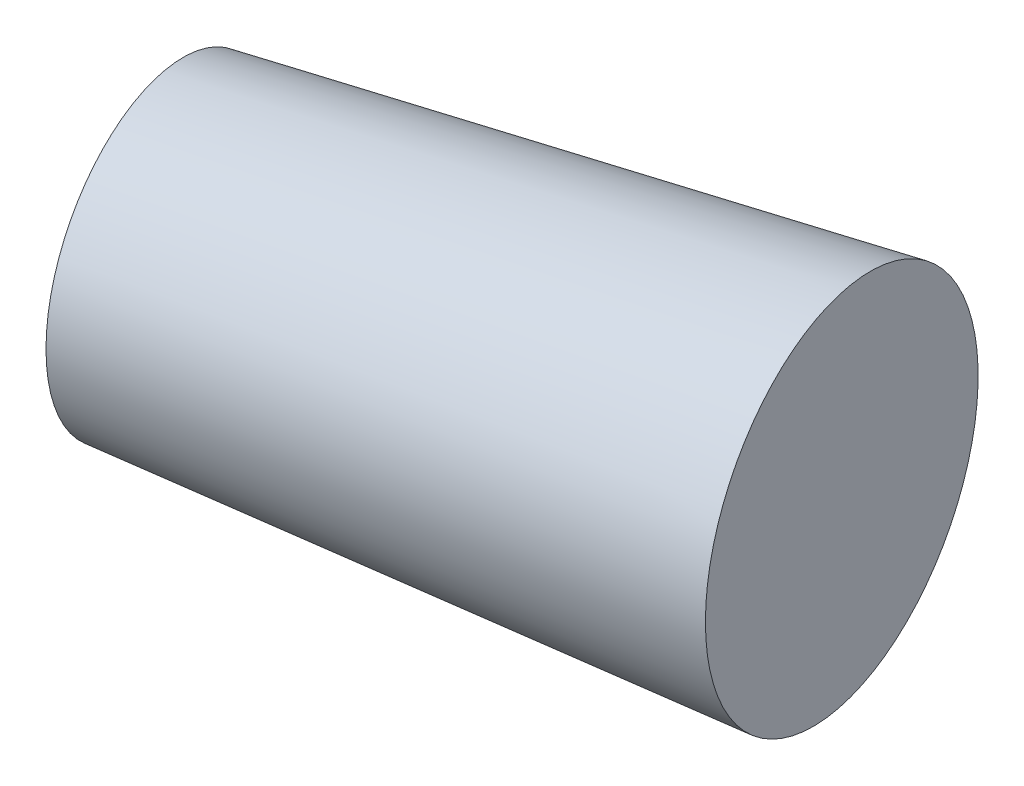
from build123d import *


with BuildPart() as part:
    # Esquisse1 → Base-R_volution (revolve)
    with BuildSketch(Plane(origin=(0, 0, 0), x_dir=(1, 0, 0), z_dir=(0, 1, 0)), mode=Mode.PRIVATE) as base_r_volution_sk:
        Polygon((-5.238989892, -1.148901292), (3.759152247, 0.824375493), (3.143304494, 3.632641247), (-5.751422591, 1.187791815), align=None)
    revolve(base_r_volution_sk.sketch.rotate(Axis((0, 0, 0), (0.9767880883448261, 0, -0.21420791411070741)), 180), axis=Axis((0, 0, 0), (0.9767880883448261, 0, -0.21420791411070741)))


solid = part.part
